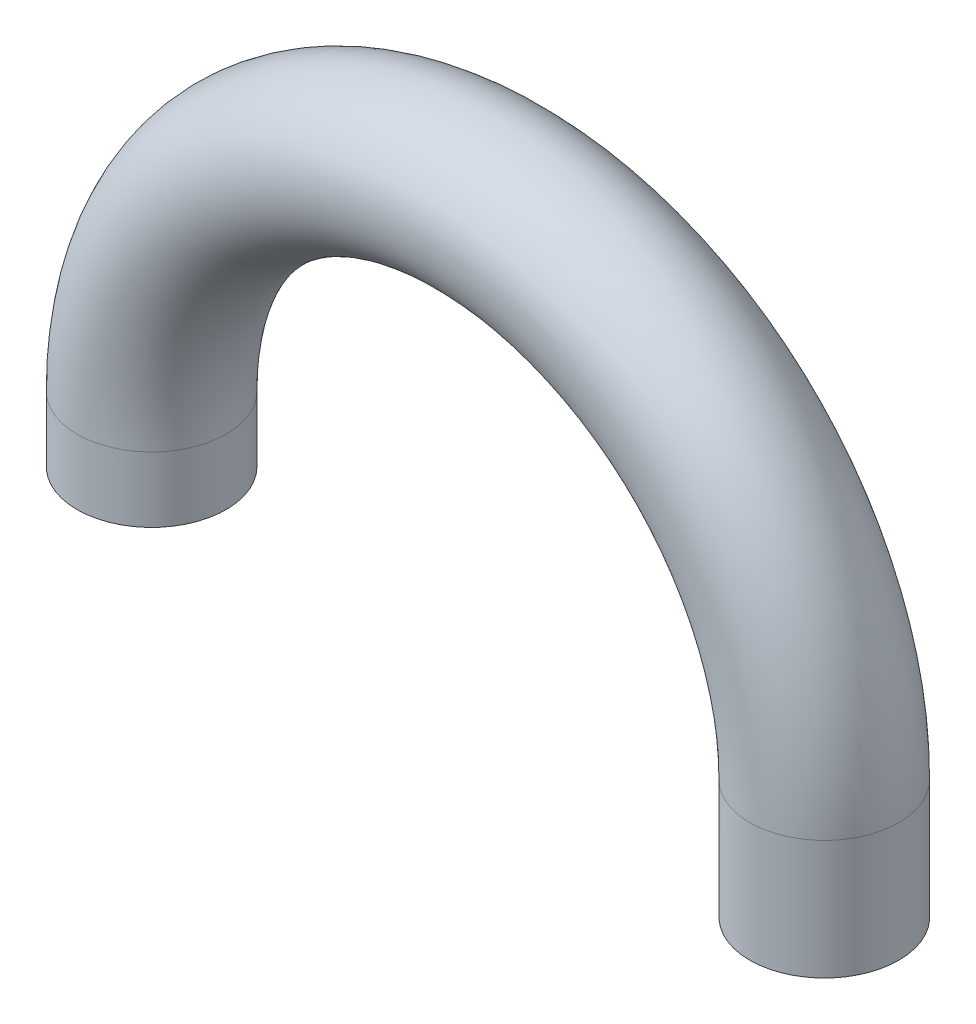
ISO-10303-21;
HEADER;
FILE_DESCRIPTION(('STEP AP214'),'2;1');
FILE_NAME('part.step','',(''),(''),'','','');
FILE_SCHEMA(('AUTOMOTIVE_DESIGN { 1 0 10303 214 1 1 1 1 }'));
ENDSEC;
DATA;
#1=APPLICATION_CONTEXT('core data for automotive mechanical design processes');
#2=APPLICATION_PROTOCOL_DEFINITION('international standard','automotive_design',2000,#1);
#3=PRODUCT_CONTEXT('',#1,'mechanical');
#4=PRODUCT('Part','Part','',(#3));
#5=PRODUCT_RELATED_PRODUCT_CATEGORY('part','',(#4));
#6=PRODUCT_DEFINITION_FORMATION('','',#4);
#7=PRODUCT_DEFINITION_CONTEXT('part definition',#1,'design');
#8=PRODUCT_DEFINITION('design','',#6,#7);
#9=PRODUCT_DEFINITION_SHAPE('','',#8);
#10=(LENGTH_UNIT() NAMED_UNIT(*) SI_UNIT(.MILLI.,.METRE.));
#11=(NAMED_UNIT(*) PLANE_ANGLE_UNIT() SI_UNIT($,.RADIAN.));
#12=(NAMED_UNIT(*) SI_UNIT($,.STERADIAN.) SOLID_ANGLE_UNIT());
#13=UNCERTAINTY_MEASURE_WITH_UNIT(LENGTH_MEASURE(1.E-05),#10,'distance_accuracy_value','');
#14=(GEOMETRIC_REPRESENTATION_CONTEXT(3) GLOBAL_UNCERTAINTY_ASSIGNED_CONTEXT((#13)) GLOBAL_UNIT_ASSIGNED_CONTEXT((#10,
#11,#12)) REPRESENTATION_CONTEXT('',''));
#15=CARTESIAN_POINT('',(0.,0.,0.));
#16=DIRECTION('',(0.,0.,1.));
#17=DIRECTION('',(1.,0.,0.));
#18=AXIS2_PLACEMENT_3D('',#15,#16,#17);
#19=CARTESIAN_POINT('',(35.8308419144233,3.47980000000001,0.));
#20=DIRECTION('',(0.,-1.,0.));
#21=DIRECTION('',(0.,0.,-1.));
#22=AXIS2_PLACEMENT_3D('',#19,#20,#21);
#23=CYLINDRICAL_SURFACE('',#22,3.96875);
#24=CARTESIAN_POINT('',(35.8308419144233,3.47980000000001,0.));
#25=DIRECTION('',(0.,-1.,0.));
#26=DIRECTION('',(0.,0.,1.));
#27=AXIS2_PLACEMENT_3D('',#24,#25,#26);
#28=CIRCLE('',#27,3.96875);
#29=CARTESIAN_POINT('',(39.7995919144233,3.47980000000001,0.));
#30=VERTEX_POINT('',#29);
#31=EDGE_CURVE('E34',#30,#30,#28,.T.);
#32=ORIENTED_EDGE('',*,*,#31,.T.);
#33=EDGE_LOOP('',(#32));
#34=FACE_BOUND('',#33,.T.);
#35=CARTESIAN_POINT('',(35.8308419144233,-2.8702,0.));
#36=DIRECTION('',(0.,-1.,0.));
#37=DIRECTION('',(0.,0.,1.));
#38=AXIS2_PLACEMENT_3D('',#35,#36,#37);
#39=CIRCLE('',#38,3.96875);
#40=CARTESIAN_POINT('',(35.8308419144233,-2.8702,3.96875000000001));
#41=VERTEX_POINT('',#40);
#42=EDGE_CURVE('E10',#41,#41,#39,.T.);
#43=ORIENTED_EDGE('',*,*,#42,.F.);
#44=EDGE_LOOP('',(#43));
#45=FACE_BOUND('',#44,.T.);
#46=ADVANCED_FACE('F28',(#34,#45),#23,.T.);
#47=CARTESIAN_POINT('',(17.9154209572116,3.47980000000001,1.17961196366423E-13));
#48=DIRECTION('',(0.,0.,-1.));
#49=DIRECTION('',(-1.,0.,0.));
#50=AXIS2_PLACEMENT_3D('',#47,#48,#49);
#51=TOROIDAL_SURFACE('',#50,17.9154209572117,3.96875);
#52=CARTESIAN_POINT('',(0.,3.47980000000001,0.));
#53=DIRECTION('',(0.,1.,0.));
#54=DIRECTION('',(0.,0.,1.));
#55=AXIS2_PLACEMENT_3D('',#52,#53,#54);
#56=CIRCLE('',#55,3.96875);
#57=CARTESIAN_POINT('',(-3.96875000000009,3.47980000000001,0.));
#58=VERTEX_POINT('',#57);
#59=EDGE_CURVE('E38',#58,#58,#56,.T.);
#60=CARTESIAN_POINT('',(17.9154209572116,3.47980000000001,1.17961196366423E-13));
#61=DIRECTION('',(0.,0.,-1.));
#62=DIRECTION('',(-1.,0.,0.));
#63=AXIS2_PLACEMENT_3D('',#60,#61,#62);
#64=CIRCLE('',#63,21.8841709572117);
#65=EDGE_CURVE('',#58,#30,#64,.T.);
#66=ORIENTED_EDGE('',*,*,#59,.T.);
#67=ORIENTED_EDGE('',*,*,#31,.F.);
#68=ORIENTED_EDGE('',*,*,#65,.T.);
#69=ORIENTED_EDGE('',*,*,#65,.F.);
#70=EDGE_LOOP('',(#66,#68,#67,#69));
#71=FACE_BOUND('',#70,.T.);
#72=ADVANCED_FACE('F60',(#71),#51,.T.);
#73=CARTESIAN_POINT('',(0.,3.47980000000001,0.));
#74=DIRECTION('',(0.,-1.,0.));
#75=DIRECTION('',(0.,0.,-1.));
#76=AXIS2_PLACEMENT_3D('',#73,#74,#75);
#77=CYLINDRICAL_SURFACE('',#76,3.96875);
#78=ORIENTED_EDGE('',*,*,#59,.F.);
#79=EDGE_LOOP('',(#78));
#80=FACE_BOUND('',#79,.T.);
#81=CARTESIAN_POINT('',(0.,0.,0.));
#82=DIRECTION('',(0.,1.,0.));
#83=DIRECTION('',(0.,0.,1.));
#84=AXIS2_PLACEMENT_3D('',#81,#82,#83);
#85=CIRCLE('',#84,3.96875);
#86=CARTESIAN_POINT('',(0.,0.,3.96875));
#87=VERTEX_POINT('',#86);
#88=EDGE_CURVE('E42',#87,#87,#85,.T.);
#89=ORIENTED_EDGE('',*,*,#88,.T.);
#90=EDGE_LOOP('',(#89));
#91=FACE_BOUND('',#90,.T.);
#92=ADVANCED_FACE('F48',(#80,#91),#77,.T.);
#93=CARTESIAN_POINT('',(35.8308419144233,-2.8702,0.));
#94=DIRECTION('',(0.,-1.,0.));
#95=DIRECTION('',(0.,0.,1.));
#96=AXIS2_PLACEMENT_3D('',#93,#94,#95);
#97=PLANE('',#96);
#98=ORIENTED_EDGE('',*,*,#42,.T.);
#99=EDGE_LOOP('',(#98));
#100=FACE_BOUND('',#99,.T.);
#101=ADVANCED_FACE('F52',(#100),#97,.T.);
#102=CARTESIAN_POINT('',(0.,0.,0.));
#103=DIRECTION('',(0.,1.,0.));
#104=DIRECTION('',(0.,0.,1.));
#105=AXIS2_PLACEMENT_3D('',#102,#103,#104);
#106=PLANE('',#105);
#107=ORIENTED_EDGE('',*,*,#88,.F.);
#108=EDGE_LOOP('',(#107));
#109=FACE_BOUND('',#108,.T.);
#110=ADVANCED_FACE('F50',(#109),#106,.F.);
#111=CLOSED_SHELL('',(#46,#72,#92,#101,#110));
#112=MANIFOLD_SOLID_BREP('B2',#111);
#113=ADVANCED_BREP_SHAPE_REPRESENTATION('',(#18,#112),#14);
#114=SHAPE_DEFINITION_REPRESENTATION(#9,#113);
ENDSEC;
END-ISO-10303-21;
